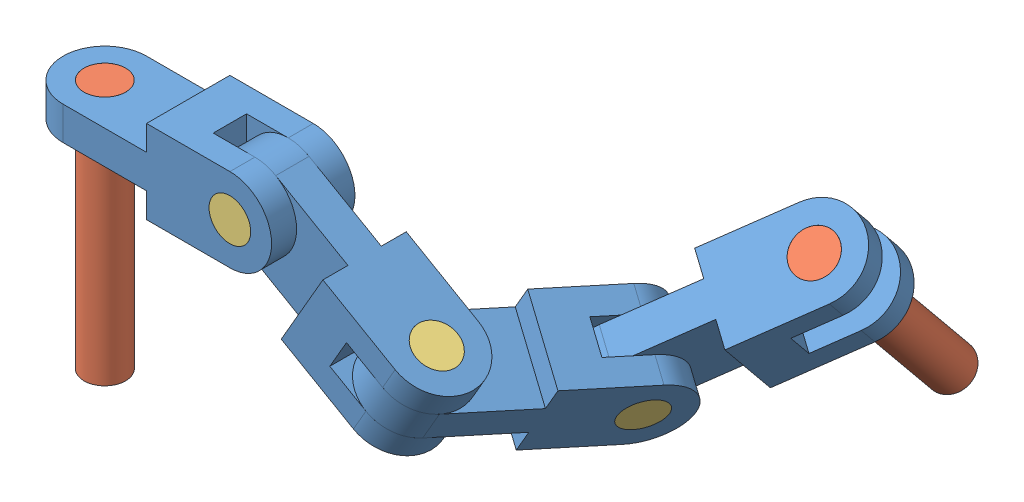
SolidWorks assembly Assemblage 2.SLDASM, configuration Default (file format 14000). Lengths in mm.
Overall size (693.47 348.3 558.36).
9 component instances, 3 part files, 22 mates.
Components (placement in the parent):
- chain_link-1: chain_link.SLDPRT [Default] at (507.64 -115.9664 -245.3472) x (0.784886 -0.453154 0.422618) z (0.094754 0.761791 0.640856) size (100 300 100)
- long_pin-1: long_pin.SLDPRT [Default] at origin size (50 300 50)
- short_pin-1: short_pin.SLDPRT [Default] at (200 -20 -50) x (1 0 0) z (0 1 0) size (50 100 50)
- chain_link-2: chain_link.SLDPRT [Default] at (100 -20 0) x (0 -1 0) z (0 0 1) size (100 300 100)
- chain_link-3: chain_link.SLDPRT [Default] at (286.6025 -70 0) x (0 0 1) z (0.5 0.866025 0) size (100 300 100)
- chain_link-4: chain_link.SLDPRT [Default] at (409.8049 -141.1309 -90.6308) x (-0.5 -0.866025 0) z (0.784886 -0.453154 0.422618) size (100 300 100)
- short_pin-2: short_pin.SLDPRT [Default] at (348.2051 -163.3013 0) x (-0.469857 0.271272 -0.840027) z (-0.727485 0.420014 0.542544) size (50 100 50)
- short_pin-3: short_pin.SLDPRT [Default] at (407.1604 -139.6041 -202.3925) x (-0.076115 0.606364 0.791536) z (-0.614948 -0.653433 0.441434) size (50 100 50)
- long_pin-2: long_pin.SLDPRT [Default] at (545.1869 -260.1186 -469.6469) x (0.962914 -0.233498 0.135189) z (0.252625 0.60428 -0.755663) size (50 300 50)
Mates (geometry in assembly coordinates):
- Coaxiale1: concentric aligned: cylinder of long_pin-1 through (0 -300 0) axis (0 1 0) radius 25
- Coïncidente1: coordinate: point of long_pin-1
- Coaxiale4: concentric anti-aligned: cylinder of long_pin-1 through (0 -300 0) axis (0 1 0) radius 25; cylinder of chain_link-2 through (0 30 0) axis (0 -1 0) radius 25
- Coïncidente6: coincident aligned: plane of long_pin-1 through (0 0 0) normal (0 1 0); plane of chain_link-2 through (0 0 0) normal (0 1 0)
- Parallèle2: parallel aligned: plane of chain_link-2 through (200 -20 50) normal (0 0 1)
- Coaxiale5: concentric anti-aligned: cylinder of short_pin-1 through (200 -20 50) axis (0 0 -1) radius 25; cylinder of chain_link-2 through (200 -20 -50) axis (0 0 1) radius 25
- Coïncidente8: coincident aligned: plane of short_pin-1 through (200 -20 50) normal (0 0 1); plane of chain_link-2 through (200 -20 50) normal (0 0 1)
- Coaxiale6: concentric anti-aligned: cylinder of short_pin-1 through (200 -20 50) axis (0 0 -1) radius 25; cylinder of chain_link-3 through (200 -20 -50) axis (0 0 1) radius 25
- Coïncidente9: coincident anti-aligned: plane of chain_link-2 through (250 30 20) normal (0 0 -1); plane of chain_link-3 through (200 -20 20) normal (0 0 1)
- Coaxiale7: concentric anti-aligned: cylinder of chain_link-3 through (348.2051 -163.3013 0) axis (0.5 0.866025 0) radius 25; cylinder of short_pin-2 through (398.2051 -76.6987 0) axis (-0.5 -0.866025 0) radius 25
- Coïncidente10: coincident aligned: plane of chain_link-3 through (398.2051 -76.6987 0) normal (0.5 0.866025 0); plane of short_pin-2 through (398.2051 -76.6987 0) normal (0.5 0.866025 0)
- Coaxiale8: concentric aligned: cylinder of chain_link-4 through (398.2051 -76.6987 0) axis (-0.5 -0.866025 0) radius 25; cylinder of short_pin-2 through (398.2051 -76.6987 0) axis (-0.5 -0.866025 0) radius 25
- Coïncidente11: coincident anti-aligned: plane of chain_link-3 through (426.5064 -127.6795 -50) normal (-0.5 -0.866025 0); plane of chain_link-4 through (383.2051 -102.6795 0) normal (0.5 0.866025 0)
- Coaxiale9: concentric anti-aligned: cylinder of chain_link-4 through (407.1604 -139.6041 -202.3925) axis (0.784886 -0.453154 0.422618) radius 25; cylinder of short_pin-3 through (485.649 -184.9195 -160.1306) axis (-0.784886 0.453154 -0.422618) radius 25
- Coïncidente12: coincident aligned: plane of chain_link-4 through (485.649 -184.9195 -160.1306) normal (0.784886 -0.453154 0.422618); plane of short_pin-3 through (485.649 -184.9195 -160.1306) normal (0.784886 -0.453154 0.422618)
- Coaxiale10: concentric anti-aligned: cylinder of chain_link-1 through (407.1604 -139.6041 -202.3925) axis (0.784886 -0.453154 0.422618) radius 25; cylinder of short_pin-3 through (485.649 -184.9195 -160.1306) axis (-0.784886 0.453154 -0.422618) radius 25
- Coïncidente13: coincident anti-aligned: plane of chain_link-1 through (462.1024 -171.3249 -172.8092) normal (0.784886 -0.453154 0.422618); plane of chain_link-4 through (505.4023 -138.5891 -218.1246) normal (-0.784886 0.453154 -0.422618)
- Coaxiale11: concentric anti-aligned: cylinder of chain_link-1 through (568.0098 -92.6715 -332.4878) axis (0.041023 0.718543 0.694272) radius 25; cylinder of long_pin-2 through (572.1121 -20.8173 -263.0606) axis (-0.041023 -0.718543 -0.694272) radius 25
- Coïncidente14: coincident aligned: plane of chain_link-1 through (572.1121 -20.8173 -263.0606) normal (0.041023 0.718543 0.694272); plane of long_pin-2 through (572.1121 -20.8173 -263.0606) normal (0.041023 0.718543 0.694272)
- Angle1: planar angle = 0.523599 rad aligned: plane of chain_link-2 through (100 30 50) normal (0 1 0); plane of chain_link-3 through (398.2051 -76.6987 0) normal (0.5 0.866025 0)
- Angle2: planar angle = 2.007129 rad anti-aligned: plane of chain_link-3 through (311.6025 -26.6987 -50) normal (0 0 -1); plane of chain_link-4 through (407.1604 -139.6041 -202.3925) normal (-0.784886 0.453154 -0.422618)
- Angle3: planar angle = 2.356194 rad anti-aligned: plane of chain_link-4 through (474.0492 -120.4873 -69.4999) normal (0.5 0.866025 0); plane of chain_link-1 through (573.613 -31.5814 -277.39) normal (0.094754 0.761791 0.640856)
